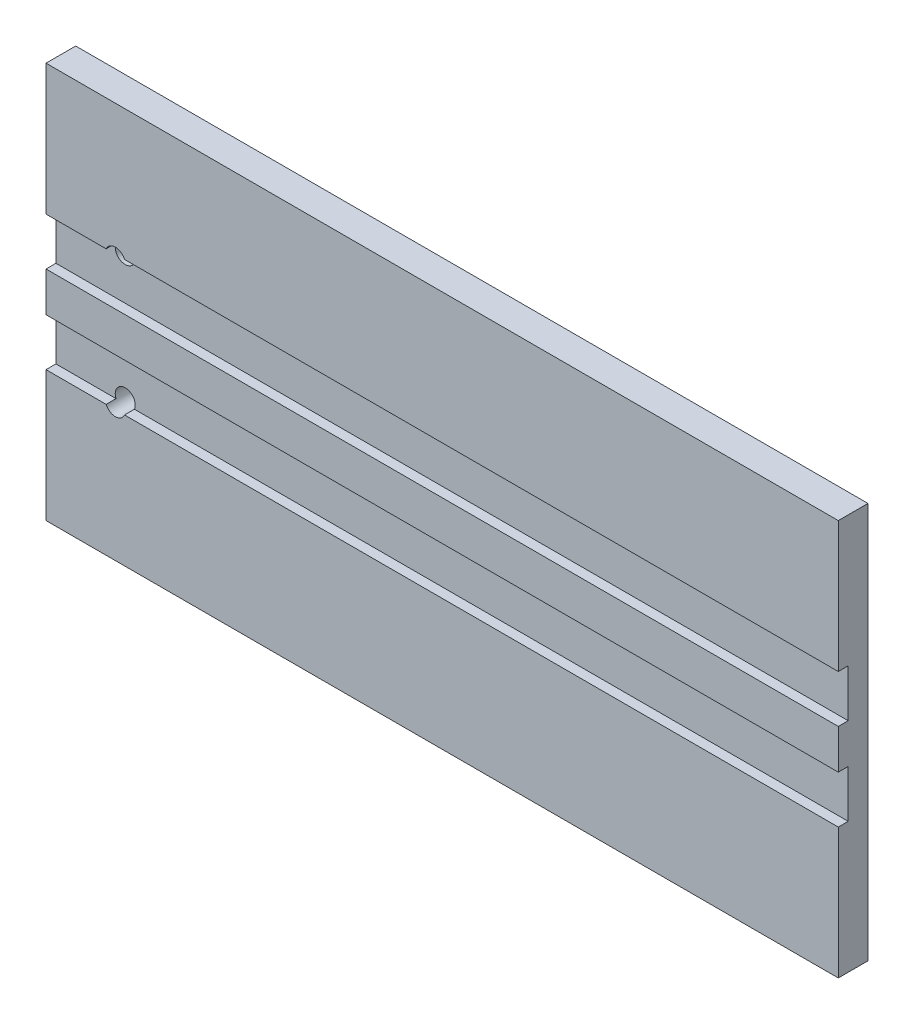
ISO-10303-21;
HEADER;
FILE_DESCRIPTION(('STEP AP214'),'2;1');
FILE_NAME('part.step','',(''),(''),'','','');
FILE_SCHEMA(('AUTOMOTIVE_DESIGN { 1 0 10303 214 1 1 1 1 }'));
ENDSEC;
DATA;
#1=APPLICATION_CONTEXT('core data for automotive mechanical design processes');
#2=APPLICATION_PROTOCOL_DEFINITION('international standard','automotive_design',2000,#1);
#3=PRODUCT_CONTEXT('',#1,'mechanical');
#4=PRODUCT('Part','Part','',(#3));
#5=PRODUCT_RELATED_PRODUCT_CATEGORY('part','',(#4));
#6=PRODUCT_DEFINITION_FORMATION('','',#4);
#7=PRODUCT_DEFINITION_CONTEXT('part definition',#1,'design');
#8=PRODUCT_DEFINITION('design','',#6,#7);
#9=PRODUCT_DEFINITION_SHAPE('','',#8);
#10=(LENGTH_UNIT() NAMED_UNIT(*) SI_UNIT(.MILLI.,.METRE.));
#11=(NAMED_UNIT(*) PLANE_ANGLE_UNIT() SI_UNIT($,.RADIAN.));
#12=(NAMED_UNIT(*) SI_UNIT($,.STERADIAN.) SOLID_ANGLE_UNIT());
#13=UNCERTAINTY_MEASURE_WITH_UNIT(LENGTH_MEASURE(1.E-05),#10,'distance_accuracy_value','');
#14=(GEOMETRIC_REPRESENTATION_CONTEXT(3) GLOBAL_UNCERTAINTY_ASSIGNED_CONTEXT((#13)) GLOBAL_UNIT_ASSIGNED_CONTEXT((#10,
#11,#12)) REPRESENTATION_CONTEXT('',''));
#15=CARTESIAN_POINT('',(0.,0.,0.));
#16=DIRECTION('',(0.,0.,1.));
#17=DIRECTION('',(1.,0.,0.));
#18=AXIS2_PLACEMENT_3D('',#15,#16,#17);
#19=CARTESIAN_POINT('',(-36.339522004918,-64.7347495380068,10.));
#20=DIRECTION('',(0.,-1.,0.));
#21=DIRECTION('',(0.,0.,-1.));
#22=AXIS2_PLACEMENT_3D('',#19,#20,#21);
#23=PLANE('',#22);
#24=DIRECTION('',(-1.,0.,0.));
#25=VECTOR('',#24,1.);
#26=CARTESIAN_POINT('',(-36.339522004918,-64.7347495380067,10.));
#27=LINE('',#26,#25);
#28=CARTESIAN_POINT('',(363.660477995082,-64.7347495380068,10.));
#29=VERTEX_POINT('',#28);
#30=CARTESIAN_POINT('',(-36.339522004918,-64.7347495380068,10.));
#31=VERTEX_POINT('',#30);
#32=EDGE_CURVE('E257',#29,#31,#27,.T.);
#33=ORIENTED_EDGE('',*,*,#32,.T.);
#34=DIRECTION('',(0.,0.,1.));
#35=VECTOR('',#34,1.);
#36=CARTESIAN_POINT('',(-36.339522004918,-64.7347495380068,0.));
#37=LINE('',#36,#35);
#38=CARTESIAN_POINT('',(-36.339522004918,-64.7347495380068,15.));
#39=VERTEX_POINT('',#38);
#40=EDGE_CURVE('E139',#39,#31,#37,.F.);
#41=ORIENTED_EDGE('',*,*,#40,.F.);
#42=DIRECTION('',(1.,0.,0.));
#43=VECTOR('',#42,1.);
#44=CARTESIAN_POINT('',(163.660477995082,-64.7347495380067,15.));
#45=LINE('',#44,#43);
#46=CARTESIAN_POINT('',(363.660477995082,-64.7347495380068,15.));
#47=VERTEX_POINT('',#46);
#48=EDGE_CURVE('E282',#47,#39,#45,.F.);
#49=ORIENTED_EDGE('',*,*,#48,.F.);
#50=DIRECTION('',(0.,0.,-1.));
#51=VECTOR('',#50,1.);
#52=CARTESIAN_POINT('',(363.660477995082,-64.7347495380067,0.));
#53=LINE('',#52,#51);
#54=EDGE_CURVE('E231',#29,#47,#53,.F.);
#55=ORIENTED_EDGE('',*,*,#54,.F.);
#56=EDGE_LOOP('',(#33,#41,#49,#55));
#57=FACE_BOUND('',#56,.T.);
#58=ADVANCED_FACE('F16',(#57),#23,.F.);
#59=CARTESIAN_POINT('',(163.660477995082,-74.7347495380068,15.));
#60=DIRECTION('',(0.,0.,1.));
#61=DIRECTION('',(1.,0.,0.));
#62=AXIS2_PLACEMENT_3D('',#59,#60,#61);
#63=PLANE('',#62);
#64=DIRECTION('',(1.,0.,0.));
#65=VECTOR('',#64,1.);
#66=CARTESIAN_POINT('',(-36.339522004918,-84.7347495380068,15.));
#67=LINE('',#66,#65);
#68=CARTESIAN_POINT('',(-36.339522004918,-84.7347495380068,15.));
#69=VERTEX_POINT('',#68);
#70=CARTESIAN_POINT('',(363.660477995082,-84.7347495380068,15.));
#71=VERTEX_POINT('',#70);
#72=EDGE_CURVE('E279',#69,#71,#67,.T.);
#73=ORIENTED_EDGE('',*,*,#72,.T.);
#74=DIRECTION('',(0.,1.,0.));
#75=VECTOR('',#74,1.);
#76=CARTESIAN_POINT('',(363.660477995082,25.2652504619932,15.));
#77=LINE('',#76,#75);
#78=EDGE_CURVE('E234',#47,#71,#77,.F.);
#79=ORIENTED_EDGE('',*,*,#78,.F.);
#80=ORIENTED_EDGE('',*,*,#48,.T.);
#81=DIRECTION('',(0.,1.,0.));
#82=VECTOR('',#81,1.);
#83=CARTESIAN_POINT('',(-36.339522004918,-174.734749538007,15.));
#84=LINE('',#83,#82);
#85=EDGE_CURVE('E244',#69,#39,#84,.T.);
#86=ORIENTED_EDGE('',*,*,#85,.F.);
#87=EDGE_LOOP('',(#73,#79,#80,#86));
#88=FACE_BOUND('',#87,.T.);
#89=ADVANCED_FACE('F289',(#88),#63,.T.);
#90=CARTESIAN_POINT('',(-36.339522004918,-84.7347495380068,15.));
#91=DIRECTION('',(0.,1.,0.));
#92=DIRECTION('',(0.,0.,1.));
#93=AXIS2_PLACEMENT_3D('',#90,#91,#92);
#94=PLANE('',#93);
#95=ORIENTED_EDGE('',*,*,#72,.F.);
#96=DIRECTION('',(0.,0.,1.));
#97=VECTOR('',#96,1.);
#98=CARTESIAN_POINT('',(-36.339522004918,-84.7347495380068,0.));
#99=LINE('',#98,#97);
#100=CARTESIAN_POINT('',(-36.339522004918,-84.7347495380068,10.));
#101=VERTEX_POINT('',#100);
#102=EDGE_CURVE('E183',#101,#69,#99,.T.);
#103=ORIENTED_EDGE('',*,*,#102,.F.);
#104=DIRECTION('',(-1.,0.,0.));
#105=VECTOR('',#104,1.);
#106=CARTESIAN_POINT('',(-36.339522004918,-84.7347495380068,10.));
#107=LINE('',#106,#105);
#108=CARTESIAN_POINT('',(363.660477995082,-84.7347495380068,10.));
#109=VERTEX_POINT('',#108);
#110=EDGE_CURVE('E270',#101,#109,#107,.F.);
#111=ORIENTED_EDGE('',*,*,#110,.T.);
#112=DIRECTION('',(0.,0.,-1.));
#113=VECTOR('',#112,1.);
#114=CARTESIAN_POINT('',(363.660477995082,-84.7347495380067,0.));
#115=LINE('',#114,#113);
#116=EDGE_CURVE('E170',#71,#109,#115,.T.);
#117=ORIENTED_EDGE('',*,*,#116,.F.);
#118=EDGE_LOOP('',(#95,#103,#111,#117));
#119=FACE_BOUND('',#118,.T.);
#120=ADVANCED_FACE('F380',(#119),#94,.F.);
#121=CARTESIAN_POINT('',(-36.339522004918,-108.734749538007,10.));
#122=DIRECTION('',(0.,-1.,0.));
#123=DIRECTION('',(0.,0.,-1.));
#124=AXIS2_PLACEMENT_3D('',#121,#122,#123);
#125=PLANE('',#124);
#126=DIRECTION('',(1.,0.,0.));
#127=VECTOR('',#126,1.);
#128=CARTESIAN_POINT('',(163.660477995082,-108.734749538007,15.));
#129=LINE('',#128,#127);
#130=CARTESIAN_POINT('',(363.660477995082,-108.734749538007,15.));
#131=VERTEX_POINT('',#130);
#132=CARTESIAN_POINT('',(3.30082377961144,-108.734749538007,15.));
#133=VERTEX_POINT('',#132);
#134=EDGE_CURVE('E111',#131,#133,#129,.F.);
#135=ORIENTED_EDGE('',*,*,#134,.F.);
#136=DIRECTION('',(0.,0.,-1.));
#137=VECTOR('',#136,1.);
#138=CARTESIAN_POINT('',(363.660477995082,-108.734749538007,0.));
#139=LINE('',#138,#137);
#140=CARTESIAN_POINT('',(363.660477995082,-108.734749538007,10.));
#141=VERTEX_POINT('',#140);
#142=EDGE_CURVE('E169',#141,#131,#139,.F.);
#143=ORIENTED_EDGE('',*,*,#142,.F.);
#144=DIRECTION('',(-1.,0.,0.));
#145=VECTOR('',#144,1.);
#146=CARTESIAN_POINT('',(-36.339522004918,-108.734749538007,10.));
#147=LINE('',#146,#145);
#148=CARTESIAN_POINT('',(3.30082377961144,-108.734749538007,10.));
#149=VERTEX_POINT('',#148);
#150=EDGE_CURVE('E266',#141,#149,#147,.T.);
#151=ORIENTED_EDGE('',*,*,#150,.T.);
#152=DIRECTION('',(0.,0.,1.));
#153=VECTOR('',#152,1.);
#154=CARTESIAN_POINT('',(3.30082377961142,-108.734749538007,7.49999999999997));
#155=LINE('',#154,#153);
#156=EDGE_CURVE('E125',#149,#133,#155,.T.);
#157=ORIENTED_EDGE('',*,*,#156,.T.);
#158=EDGE_LOOP('',(#135,#143,#151,#157));
#159=FACE_BOUND('',#158,.T.);
#160=ADVANCED_FACE('F377',(#159),#125,.F.);
#161=CARTESIAN_POINT('',(163.660477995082,-74.7347495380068,15.));
#162=DIRECTION('',(0.,0.,1.));
#163=DIRECTION('',(1.,0.,0.));
#164=AXIS2_PLACEMENT_3D('',#161,#162,#163);
#165=PLANE('',#164);
#166=DIRECTION('',(0.,1.,0.));
#167=VECTOR('',#166,1.);
#168=CARTESIAN_POINT('',(363.660477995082,25.2652504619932,15.));
#169=LINE('',#168,#167);
#170=CARTESIAN_POINT('',(363.660477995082,-174.734749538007,15.));
#171=VERTEX_POINT('',#170);
#172=EDGE_CURVE('E174',#131,#171,#169,.F.);
#173=ORIENTED_EDGE('',*,*,#172,.F.);
#174=ORIENTED_EDGE('',*,*,#134,.T.);
#175=CARTESIAN_POINT('',(-1.339522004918,-106.734749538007,15.));
#176=DIRECTION('',(0.,0.,-1.));
#177=DIRECTION('',(-1.,0.,0.));
#178=AXIS2_PLACEMENT_3D('',#175,#176,#177);
#179=CIRCLE('',#178,5.05300000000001);
#180=CARTESIAN_POINT('',(-5.97986778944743,-108.734749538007,15.));
#181=VERTEX_POINT('',#180);
#182=EDGE_CURVE('E20',#133,#181,#179,.T.);
#183=ORIENTED_EDGE('',*,*,#182,.T.);
#184=DIRECTION('',(1.,0.,0.));
#185=VECTOR('',#184,1.);
#186=CARTESIAN_POINT('',(-36.339522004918,-108.734749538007,15.));
#187=LINE('',#186,#185);
#188=CARTESIAN_POINT('',(-36.339522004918,-108.734749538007,15.));
#189=VERTEX_POINT('',#188);
#190=EDGE_CURVE('E101',#181,#189,#187,.F.);
#191=ORIENTED_EDGE('',*,*,#190,.T.);
#192=DIRECTION('',(0.,1.,0.));
#193=VECTOR('',#192,1.);
#194=CARTESIAN_POINT('',(-36.339522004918,-174.734749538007,15.));
#195=LINE('',#194,#193);
#196=CARTESIAN_POINT('',(-36.339522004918,-174.734749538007,15.));
#197=VERTEX_POINT('',#196);
#198=EDGE_CURVE('E163',#197,#189,#195,.T.);
#199=ORIENTED_EDGE('',*,*,#198,.F.);
#200=DIRECTION('',(1.,0.,0.));
#201=VECTOR('',#200,1.);
#202=CARTESIAN_POINT('',(363.660477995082,-174.734749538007,15.));
#203=LINE('',#202,#201);
#204=EDGE_CURVE('E241',#171,#197,#203,.F.);
#205=ORIENTED_EDGE('',*,*,#204,.F.);
#206=EDGE_LOOP('',(#173,#174,#183,#191,#199,#205));
#207=FACE_BOUND('',#206,.T.);
#208=ADVANCED_FACE('F123',(#207),#165,.T.);
#209=CARTESIAN_POINT('',(-36.339522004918,-108.734749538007,10.));
#210=DIRECTION('',(0.,-1.,0.));
#211=DIRECTION('',(0.,0.,-1.));
#212=AXIS2_PLACEMENT_3D('',#209,#210,#211);
#213=PLANE('',#212);
#214=DIRECTION('',(-1.,0.,0.));
#215=VECTOR('',#214,1.);
#216=CARTESIAN_POINT('',(-36.339522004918,-108.734749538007,10.));
#217=LINE('',#216,#215);
#218=CARTESIAN_POINT('',(-5.97986778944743,-108.734749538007,9.99999999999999));
#219=VERTEX_POINT('',#218);
#220=CARTESIAN_POINT('',(-36.339522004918,-108.734749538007,10.));
#221=VERTEX_POINT('',#220);
#222=EDGE_CURVE('E110',#219,#221,#217,.T.);
#223=ORIENTED_EDGE('',*,*,#222,.T.);
#224=DIRECTION('',(0.,0.,1.));
#225=VECTOR('',#224,1.);
#226=CARTESIAN_POINT('',(-36.339522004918,-108.734749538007,0.));
#227=LINE('',#226,#225);
#228=EDGE_CURVE('E106',#189,#221,#227,.F.);
#229=ORIENTED_EDGE('',*,*,#228,.F.);
#230=ORIENTED_EDGE('',*,*,#190,.F.);
#231=DIRECTION('',(0.,0.,-1.));
#232=VECTOR('',#231,1.);
#233=CARTESIAN_POINT('',(-5.97986778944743,-108.734749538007,7.49999999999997));
#234=LINE('',#233,#232);
#235=EDGE_CURVE('E105',#181,#219,#234,.T.);
#236=ORIENTED_EDGE('',*,*,#235,.T.);
#237=EDGE_LOOP('',(#223,#229,#230,#236));
#238=FACE_BOUND('',#237,.T.);
#239=ADVANCED_FACE('F104',(#238),#213,.F.);
#240=CARTESIAN_POINT('',(-36.339522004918,-84.7347495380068,10.));
#241=DIRECTION('',(0.,0.,-1.));
#242=DIRECTION('',(-1.,0.,0.));
#243=AXIS2_PLACEMENT_3D('',#240,#241,#242);
#244=PLANE('',#243);
#245=CARTESIAN_POINT('',(-1.339522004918,-106.734749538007,9.99999999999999));
#246=DIRECTION('',(0.,0.,-1.));
#247=DIRECTION('',(-1.,0.,0.));
#248=AXIS2_PLACEMENT_3D('',#245,#246,#247);
#249=CIRCLE('',#248,5.05300000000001);
#250=EDGE_CURVE('E120',#219,#149,#249,.T.);
#251=ORIENTED_EDGE('',*,*,#250,.T.);
#252=ORIENTED_EDGE('',*,*,#150,.F.);
#253=DIRECTION('',(0.,1.,0.));
#254=VECTOR('',#253,1.);
#255=CARTESIAN_POINT('',(363.660477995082,25.2652504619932,10.));
#256=LINE('',#255,#254);
#257=EDGE_CURVE('E166',#109,#141,#256,.F.);
#258=ORIENTED_EDGE('',*,*,#257,.F.);
#259=ORIENTED_EDGE('',*,*,#110,.F.);
#260=DIRECTION('',(0.,1.,0.));
#261=VECTOR('',#260,1.);
#262=CARTESIAN_POINT('',(-36.339522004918,-174.734749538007,10.));
#263=LINE('',#262,#261);
#264=EDGE_CURVE('E178',#221,#101,#263,.T.);
#265=ORIENTED_EDGE('',*,*,#264,.F.);
#266=ORIENTED_EDGE('',*,*,#222,.F.);
#267=EDGE_LOOP('',(#251,#252,#258,#259,#265,#266));
#268=FACE_BOUND('',#267,.T.);
#269=ADVANCED_FACE('F370',(#268),#244,.F.);
#270=CARTESIAN_POINT('',(-36.339522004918,-40.7347495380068,15.));
#271=DIRECTION('',(0.,1.,0.));
#272=DIRECTION('',(0.,0.,1.));
#273=AXIS2_PLACEMENT_3D('',#270,#271,#272);
#274=PLANE('',#273);
#275=DIRECTION('',(1.,0.,0.));
#276=VECTOR('',#275,1.);
#277=CARTESIAN_POINT('',(163.660477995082,-40.7347495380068,15.));
#278=LINE('',#277,#276);
#279=CARTESIAN_POINT('',(-36.339522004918,-40.7347495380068,15.));
#280=VERTEX_POINT('',#279);
#281=CARTESIAN_POINT('',(-5.9798677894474,-40.7347495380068,15.));
#282=VERTEX_POINT('',#281);
#283=EDGE_CURVE('E217',#280,#282,#278,.T.);
#284=ORIENTED_EDGE('',*,*,#283,.F.);
#285=DIRECTION('',(0.,0.,1.));
#286=VECTOR('',#285,1.);
#287=CARTESIAN_POINT('',(-36.339522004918,-40.7347495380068,0.));
#288=LINE('',#287,#286);
#289=CARTESIAN_POINT('',(-36.339522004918,-40.7347495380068,10.));
#290=VERTEX_POINT('',#289);
#291=EDGE_CURVE('E138',#290,#280,#288,.T.);
#292=ORIENTED_EDGE('',*,*,#291,.F.);
#293=DIRECTION('',(-1.,0.,0.));
#294=VECTOR('',#293,1.);
#295=CARTESIAN_POINT('',(-36.339522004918,-40.7347495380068,10.));
#296=LINE('',#295,#294);
#297=CARTESIAN_POINT('',(-5.97986778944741,-40.7347495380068,10.));
#298=VERTEX_POINT('',#297);
#299=EDGE_CURVE('E248',#290,#298,#296,.F.);
#300=ORIENTED_EDGE('',*,*,#299,.T.);
#301=DIRECTION('',(0.,0.,1.));
#302=VECTOR('',#301,1.);
#303=CARTESIAN_POINT('',(-5.9798677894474,-40.7347495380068,7.49999999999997));
#304=LINE('',#303,#302);
#305=EDGE_CURVE('E202',#298,#282,#304,.T.);
#306=ORIENTED_EDGE('',*,*,#305,.T.);
#307=EDGE_LOOP('',(#284,#292,#300,#306));
#308=FACE_BOUND('',#307,.T.);
#309=ADVANCED_FACE('F307',(#308),#274,.F.);
#310=CARTESIAN_POINT('',(163.660477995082,-74.7347495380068,15.));
#311=DIRECTION('',(0.,0.,1.));
#312=DIRECTION('',(1.,0.,0.));
#313=AXIS2_PLACEMENT_3D('',#310,#311,#312);
#314=PLANE('',#313);
#315=DIRECTION('',(0.,1.,0.));
#316=VECTOR('',#315,1.);
#317=CARTESIAN_POINT('',(-36.339522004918,-174.734749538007,15.));
#318=LINE('',#317,#316);
#319=CARTESIAN_POINT('',(-36.339522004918,25.2652504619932,15.));
#320=VERTEX_POINT('',#319);
#321=EDGE_CURVE('E143',#280,#320,#318,.T.);
#322=ORIENTED_EDGE('',*,*,#321,.F.);
#323=ORIENTED_EDGE('',*,*,#283,.T.);
#324=CARTESIAN_POINT('',(-1.33952200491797,-42.7347495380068,15.));
#325=DIRECTION('',(0.,0.,-1.));
#326=DIRECTION('',(-1.,0.,0.));
#327=AXIS2_PLACEMENT_3D('',#324,#325,#326);
#328=CIRCLE('',#327,5.05300000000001);
#329=CARTESIAN_POINT('',(3.30082377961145,-40.7347495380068,15.));
#330=VERTEX_POINT('',#329);
#331=EDGE_CURVE('E200',#282,#330,#328,.T.);
#332=ORIENTED_EDGE('',*,*,#331,.T.);
#333=DIRECTION('',(1.,0.,0.));
#334=VECTOR('',#333,1.);
#335=CARTESIAN_POINT('',(-36.339522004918,-40.7347495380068,15.));
#336=LINE('',#335,#334);
#337=CARTESIAN_POINT('',(363.660477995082,-40.7347495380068,15.));
#338=VERTEX_POINT('',#337);
#339=EDGE_CURVE('E213',#330,#338,#336,.T.);
#340=ORIENTED_EDGE('',*,*,#339,.T.);
#341=DIRECTION('',(0.,1.,0.));
#342=VECTOR('',#341,1.);
#343=CARTESIAN_POINT('',(363.660477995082,25.2652504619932,15.));
#344=LINE('',#343,#342);
#345=CARTESIAN_POINT('',(363.660477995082,25.2652504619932,15.));
#346=VERTEX_POINT('',#345);
#347=EDGE_CURVE('E149',#346,#338,#344,.F.);
#348=ORIENTED_EDGE('',*,*,#347,.F.);
#349=DIRECTION('',(1.,0.,0.));
#350=VECTOR('',#349,1.);
#351=CARTESIAN_POINT('',(-36.339522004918,25.2652504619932,15.));
#352=LINE('',#351,#350);
#353=EDGE_CURVE('E154',#320,#346,#352,.T.);
#354=ORIENTED_EDGE('',*,*,#353,.F.);
#355=EDGE_LOOP('',(#322,#323,#332,#340,#348,#354));
#356=FACE_BOUND('',#355,.T.);
#357=ADVANCED_FACE('F312',(#356),#314,.T.);
#358=CARTESIAN_POINT('',(-36.339522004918,-40.7347495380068,15.));
#359=DIRECTION('',(0.,1.,0.));
#360=DIRECTION('',(0.,0.,1.));
#361=AXIS2_PLACEMENT_3D('',#358,#359,#360);
#362=PLANE('',#361);
#363=DIRECTION('',(-1.,0.,0.));
#364=VECTOR('',#363,1.);
#365=CARTESIAN_POINT('',(-36.339522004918,-40.7347495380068,10.));
#366=LINE('',#365,#364);
#367=CARTESIAN_POINT('',(3.30082377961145,-40.7347495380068,10.));
#368=VERTEX_POINT('',#367);
#369=CARTESIAN_POINT('',(363.660477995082,-40.7347495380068,10.));
#370=VERTEX_POINT('',#369);
#371=EDGE_CURVE('E216',#368,#370,#366,.F.);
#372=ORIENTED_EDGE('',*,*,#371,.T.);
#373=DIRECTION('',(0.,0.,-1.));
#374=VECTOR('',#373,1.);
#375=CARTESIAN_POINT('',(363.660477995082,-40.7347495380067,0.));
#376=LINE('',#375,#374);
#377=EDGE_CURVE('E146',#338,#370,#376,.T.);
#378=ORIENTED_EDGE('',*,*,#377,.F.);
#379=ORIENTED_EDGE('',*,*,#339,.F.);
#380=DIRECTION('',(0.,0.,-1.));
#381=VECTOR('',#380,1.);
#382=CARTESIAN_POINT('',(3.30082377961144,-40.7347495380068,7.49999999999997));
#383=LINE('',#382,#381);
#384=EDGE_CURVE('E199',#330,#368,#383,.T.);
#385=ORIENTED_EDGE('',*,*,#384,.T.);
#386=EDGE_LOOP('',(#372,#378,#379,#385));
#387=FACE_BOUND('',#386,.T.);
#388=ADVANCED_FACE('F338',(#387),#362,.F.);
#389=CARTESIAN_POINT('',(-36.339522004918,-40.7347495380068,10.));
#390=DIRECTION('',(0.,0.,-1.));
#391=DIRECTION('',(-1.,0.,0.));
#392=AXIS2_PLACEMENT_3D('',#389,#390,#391);
#393=PLANE('',#392);
#394=CARTESIAN_POINT('',(-1.33952200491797,-42.7347495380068,10.));
#395=DIRECTION('',(0.,0.,-1.));
#396=DIRECTION('',(-1.,0.,0.));
#397=AXIS2_PLACEMENT_3D('',#394,#395,#396);
#398=CIRCLE('',#397,5.05300000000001);
#399=EDGE_CURVE('E196',#368,#298,#398,.T.);
#400=ORIENTED_EDGE('',*,*,#399,.T.);
#401=ORIENTED_EDGE('',*,*,#299,.F.);
#402=DIRECTION('',(0.,1.,0.));
#403=VECTOR('',#402,1.);
#404=CARTESIAN_POINT('',(-36.339522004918,-174.734749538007,10.));
#405=LINE('',#404,#403);
#406=EDGE_CURVE('E135',#31,#290,#405,.T.);
#407=ORIENTED_EDGE('',*,*,#406,.F.);
#408=ORIENTED_EDGE('',*,*,#32,.F.);
#409=DIRECTION('',(0.,1.,0.));
#410=VECTOR('',#409,1.);
#411=CARTESIAN_POINT('',(363.660477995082,25.2652504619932,10.));
#412=LINE('',#411,#410);
#413=EDGE_CURVE('E148',#370,#29,#412,.F.);
#414=ORIENTED_EDGE('',*,*,#413,.F.);
#415=ORIENTED_EDGE('',*,*,#371,.F.);
#416=EDGE_LOOP('',(#400,#401,#407,#408,#414,#415));
#417=FACE_BOUND('',#416,.T.);
#418=ADVANCED_FACE('F305',(#417),#393,.F.);
#419=CARTESIAN_POINT('',(-36.339522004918,-174.734749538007,0.));
#420=DIRECTION('',(-1.,0.,0.));
#421=DIRECTION('',(0.,0.,1.));
#422=AXIS2_PLACEMENT_3D('',#419,#420,#421);
#423=PLANE('',#422);
#424=ORIENTED_EDGE('',*,*,#102,.T.);
#425=ORIENTED_EDGE('',*,*,#85,.T.);
#426=ORIENTED_EDGE('',*,*,#40,.T.);
#427=ORIENTED_EDGE('',*,*,#406,.T.);
#428=ORIENTED_EDGE('',*,*,#291,.T.);
#429=ORIENTED_EDGE('',*,*,#321,.T.);
#430=DIRECTION('',(0.,0.,1.));
#431=VECTOR('',#430,1.);
#432=CARTESIAN_POINT('',(-36.339522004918,25.2652504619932,0.));
#433=LINE('',#432,#431);
#434=CARTESIAN_POINT('',(-36.339522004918,25.2652504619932,0.));
#435=VERTEX_POINT('',#434);
#436=EDGE_CURVE('E126',#435,#320,#433,.T.);
#437=ORIENTED_EDGE('',*,*,#436,.F.);
#438=DIRECTION('',(0.,1.,0.));
#439=VECTOR('',#438,1.);
#440=CARTESIAN_POINT('',(-36.339522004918,-74.7347495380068,0.));
#441=LINE('',#440,#439);
#442=CARTESIAN_POINT('',(-36.339522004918,-174.734749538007,0.));
#443=VERTEX_POINT('',#442);
#444=EDGE_CURVE('E198',#435,#443,#441,.F.);
#445=ORIENTED_EDGE('',*,*,#444,.T.);
#446=DIRECTION('',(0.,0.,-1.));
#447=VECTOR('',#446,1.);
#448=CARTESIAN_POINT('',(-36.339522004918,-174.734749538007,0.));
#449=LINE('',#448,#447);
#450=EDGE_CURVE('E235',#197,#443,#449,.T.);
#451=ORIENTED_EDGE('',*,*,#450,.F.);
#452=ORIENTED_EDGE('',*,*,#198,.T.);
#453=ORIENTED_EDGE('',*,*,#228,.T.);
#454=ORIENTED_EDGE('',*,*,#264,.T.);
#455=EDGE_LOOP('',(#424,#425,#426,#427,#428,#429,#437,#445,#451,#452,#453,#454));
#456=FACE_BOUND('',#455,.T.);
#457=ADVANCED_FACE('F297',(#456),#423,.T.);
#458=CARTESIAN_POINT('',(363.660477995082,-174.734749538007,0.));
#459=DIRECTION('',(0.,-1.,0.));
#460=DIRECTION('',(0.,0.,-1.));
#461=AXIS2_PLACEMENT_3D('',#458,#459,#460);
#462=PLANE('',#461);
#463=DIRECTION('',(1.,0.,0.));
#464=VECTOR('',#463,1.);
#465=CARTESIAN_POINT('',(163.660477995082,-174.734749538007,0.));
#466=LINE('',#465,#464);
#467=CARTESIAN_POINT('',(363.660477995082,-174.734749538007,0.));
#468=VERTEX_POINT('',#467);
#469=EDGE_CURVE('E222',#443,#468,#466,.T.);
#470=ORIENTED_EDGE('',*,*,#469,.T.);
#471=DIRECTION('',(0.,0.,-1.));
#472=VECTOR('',#471,1.);
#473=CARTESIAN_POINT('',(363.660477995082,-174.734749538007,0.));
#474=LINE('',#473,#472);
#475=EDGE_CURVE('E158',#171,#468,#474,.T.);
#476=ORIENTED_EDGE('',*,*,#475,.F.);
#477=ORIENTED_EDGE('',*,*,#204,.T.);
#478=ORIENTED_EDGE('',*,*,#450,.T.);
#479=EDGE_LOOP('',(#470,#476,#477,#478));
#480=FACE_BOUND('',#479,.T.);
#481=ADVANCED_FACE('F325',(#480),#462,.T.);
#482=CARTESIAN_POINT('',(363.660477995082,25.2652504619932,0.));
#483=DIRECTION('',(1.,0.,0.));
#484=DIRECTION('',(0.,0.,-1.));
#485=AXIS2_PLACEMENT_3D('',#482,#483,#484);
#486=PLANE('',#485);
#487=ORIENTED_EDGE('',*,*,#377,.T.);
#488=ORIENTED_EDGE('',*,*,#413,.T.);
#489=ORIENTED_EDGE('',*,*,#54,.T.);
#490=ORIENTED_EDGE('',*,*,#78,.T.);
#491=ORIENTED_EDGE('',*,*,#116,.T.);
#492=ORIENTED_EDGE('',*,*,#257,.T.);
#493=ORIENTED_EDGE('',*,*,#142,.T.);
#494=ORIENTED_EDGE('',*,*,#172,.T.);
#495=ORIENTED_EDGE('',*,*,#475,.T.);
#496=DIRECTION('',(0.,1.,0.));
#497=VECTOR('',#496,1.);
#498=CARTESIAN_POINT('',(363.660477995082,-74.7347495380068,0.));
#499=LINE('',#498,#497);
#500=CARTESIAN_POINT('',(363.660477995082,25.2652504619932,0.));
#501=VERTEX_POINT('',#500);
#502=EDGE_CURVE('E225',#468,#501,#499,.T.);
#503=ORIENTED_EDGE('',*,*,#502,.T.);
#504=DIRECTION('',(0.,0.,1.));
#505=VECTOR('',#504,1.);
#506=CARTESIAN_POINT('',(363.660477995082,25.2652504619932,0.));
#507=LINE('',#506,#505);
#508=EDGE_CURVE('E35',#346,#501,#507,.F.);
#509=ORIENTED_EDGE('',*,*,#508,.F.);
#510=ORIENTED_EDGE('',*,*,#347,.T.);
#511=EDGE_LOOP('',(#487,#488,#489,#490,#491,#492,#493,#494,#495,#503,#509,#510));
#512=FACE_BOUND('',#511,.T.);
#513=ADVANCED_FACE('F321',(#512),#486,.T.);
#514=CARTESIAN_POINT('',(-36.339522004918,25.2652504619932,0.));
#515=DIRECTION('',(0.,1.,0.));
#516=DIRECTION('',(0.,0.,1.));
#517=AXIS2_PLACEMENT_3D('',#514,#515,#516);
#518=PLANE('',#517);
#519=DIRECTION('',(1.,0.,0.));
#520=VECTOR('',#519,1.);
#521=CARTESIAN_POINT('',(163.660477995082,25.2652504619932,0.));
#522=LINE('',#521,#520);
#523=EDGE_CURVE('E195',#501,#435,#522,.F.);
#524=ORIENTED_EDGE('',*,*,#523,.T.);
#525=ORIENTED_EDGE('',*,*,#436,.T.);
#526=ORIENTED_EDGE('',*,*,#353,.T.);
#527=ORIENTED_EDGE('',*,*,#508,.T.);
#528=EDGE_LOOP('',(#524,#525,#526,#527));
#529=FACE_BOUND('',#528,.T.);
#530=ADVANCED_FACE('F315',(#529),#518,.T.);
#531=CARTESIAN_POINT('',(-1.339522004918,-106.734749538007,14.9999999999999));
#532=DIRECTION('',(0.,0.,-1.));
#533=DIRECTION('',(-1.,0.,0.));
#534=AXIS2_PLACEMENT_3D('',#531,#532,#533);
#535=CYLINDRICAL_SURFACE('',#534,5.05300000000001);
#536=CARTESIAN_POINT('',(-1.339522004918,-106.734749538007,0.));
#537=DIRECTION('',(0.,0.,-1.));
#538=DIRECTION('',(-1.,0.,0.));
#539=AXIS2_PLACEMENT_3D('',#536,#537,#538);
#540=CIRCLE('',#539,5.05300000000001);
#541=CARTESIAN_POINT('',(-6.392522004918,-106.734749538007,0.));
#542=VERTEX_POINT('',#541);
#543=EDGE_CURVE('E26',#542,#542,#540,.T.);
#544=ORIENTED_EDGE('',*,*,#543,.T.);
#545=EDGE_LOOP('',(#544));
#546=FACE_BOUND('',#545,.T.);
#547=ORIENTED_EDGE('',*,*,#156,.F.);
#548=ORIENTED_EDGE('',*,*,#250,.F.);
#549=ORIENTED_EDGE('',*,*,#235,.F.);
#550=ORIENTED_EDGE('',*,*,#182,.F.);
#551=EDGE_LOOP('',(#547,#548,#549,#550));
#552=FACE_BOUND('',#551,.T.);
#553=ADVANCED_FACE('F117',(#546,#552),#535,.F.);
#554=CARTESIAN_POINT('',(-1.33952200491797,-42.7347495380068,10.));
#555=DIRECTION('',(0.,0.,-1.));
#556=DIRECTION('',(-1.,0.,0.));
#557=AXIS2_PLACEMENT_3D('',#554,#555,#556);
#558=CYLINDRICAL_SURFACE('',#557,5.05300000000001);
#559=CARTESIAN_POINT('',(-1.33952200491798,-42.7347495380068,0.));
#560=DIRECTION('',(0.,0.,-1.));
#561=DIRECTION('',(-1.,0.,0.));
#562=AXIS2_PLACEMENT_3D('',#559,#560,#561);
#563=CIRCLE('',#562,5.05300000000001);
#564=CARTESIAN_POINT('',(-6.39252200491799,-42.7347495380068,0.));
#565=VERTEX_POINT('',#564);
#566=EDGE_CURVE('E10',#565,#565,#563,.T.);
#567=ORIENTED_EDGE('',*,*,#566,.T.);
#568=EDGE_LOOP('',(#567));
#569=FACE_BOUND('',#568,.T.);
#570=ORIENTED_EDGE('',*,*,#305,.F.);
#571=ORIENTED_EDGE('',*,*,#399,.F.);
#572=ORIENTED_EDGE('',*,*,#384,.F.);
#573=ORIENTED_EDGE('',*,*,#331,.F.);
#574=EDGE_LOOP('',(#570,#571,#572,#573));
#575=FACE_BOUND('',#574,.T.);
#576=ADVANCED_FACE('F18',(#569,#575),#558,.F.);
#577=CARTESIAN_POINT('',(163.660477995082,-74.7347495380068,0.));
#578=DIRECTION('',(0.,0.,1.));
#579=DIRECTION('',(1.,0.,0.));
#580=AXIS2_PLACEMENT_3D('',#577,#578,#579);
#581=PLANE('',#580);
#582=ORIENTED_EDGE('',*,*,#566,.F.);
#583=EDGE_LOOP('',(#582));
#584=FACE_BOUND('',#583,.T.);
#585=ORIENTED_EDGE('',*,*,#543,.F.);
#586=EDGE_LOOP('',(#585));
#587=FACE_BOUND('',#586,.T.);
#588=ORIENTED_EDGE('',*,*,#502,.F.);
#589=ORIENTED_EDGE('',*,*,#469,.F.);
#590=ORIENTED_EDGE('',*,*,#444,.F.);
#591=ORIENTED_EDGE('',*,*,#523,.F.);
#592=EDGE_LOOP('',(#588,#589,#590,#591));
#593=FACE_BOUND('',#592,.T.);
#594=ADVANCED_FACE('F318',(#584,#587,#593),#581,.F.);
#595=CLOSED_SHELL('',(#58,#89,#120,#160,#208,#239,#269,#309,#357,#388,#418,#457,#481,#513,#530,
#553,#576,#594));
#596=MANIFOLD_SOLID_BREP('B1',#595);
#597=ADVANCED_BREP_SHAPE_REPRESENTATION('',(#18,#596),#14);
#598=SHAPE_DEFINITION_REPRESENTATION(#9,#597);
ENDSEC;
END-ISO-10303-21;
